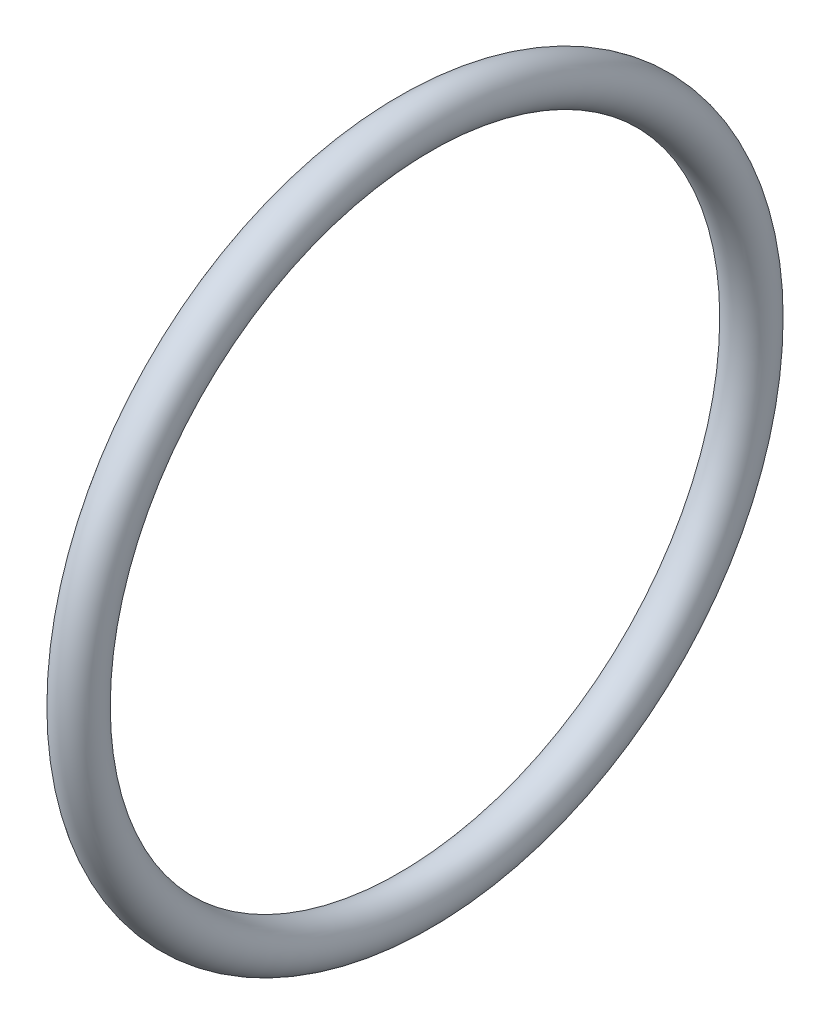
from build123d import *

# Parameters (mm, degrees)
ESQUISSE1_R = 1


with BuildPart() as part:
    # Esquisse1 → Base-R_volution (revolve)
    with BuildSketch(Plane.XY, mode=Mode.PRIVATE) as base_r_volution_sk:
        with Locations((0, 15)):
            Circle(ESQUISSE1_R)
    revolve(base_r_volution_sk.sketch.rotate(Axis((-36, 0, 0), (1, 0, 0)), 90), axis=Axis((-36, 0, 0), (1, 0, 0)))


solid = part.part
